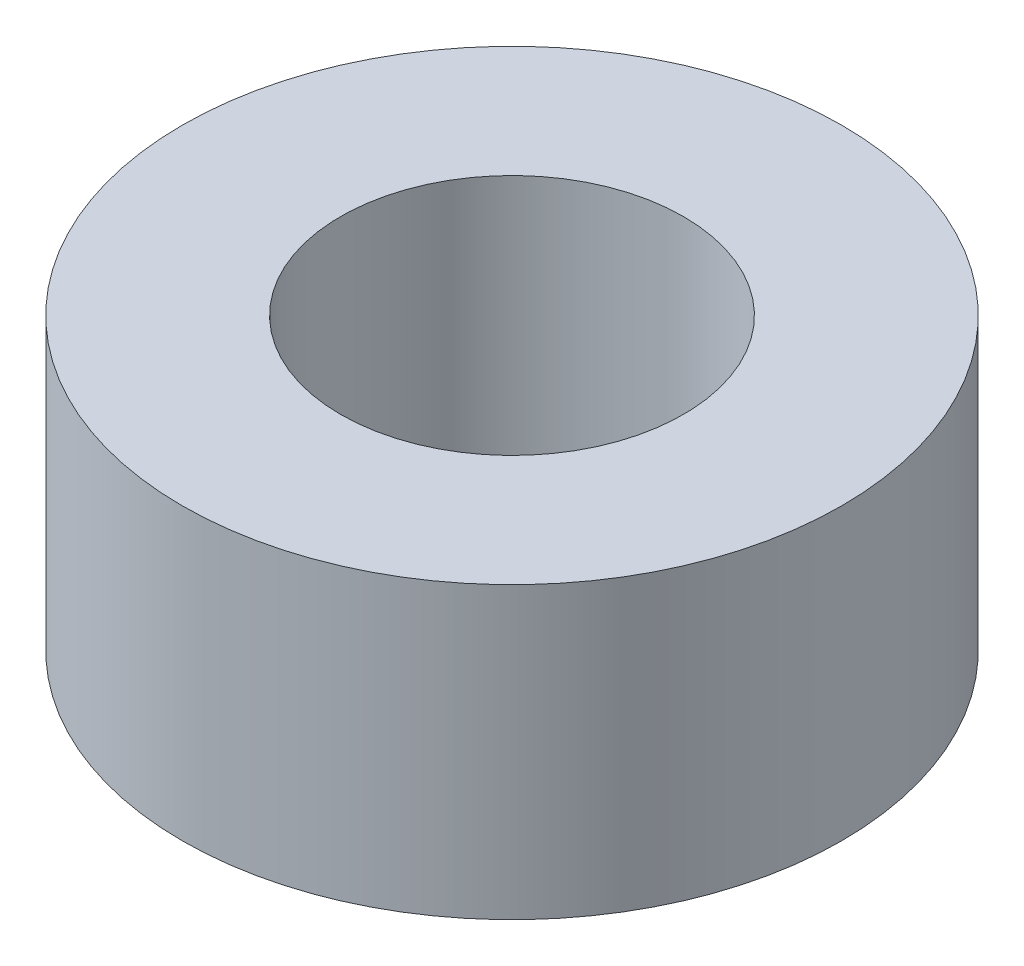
from build123d import *

# Parameters (mm, degrees)
SKETCH1_R      = 3.175
SKETCH1_R_2    = 1.651
EXTRUDE1_DEPTH = 1.397


with BuildPart() as part:
    # Sketch1 → Extrude1 (new, symmetric)
    with BuildSketch(Plane(origin=(0, 0, 0), x_dir=(1, 0, 0), z_dir=(0, 1, 0))):
        with Locations(Location((0, 0, 0), (0, 0, 270))):
            Circle(SKETCH1_R)
        with Locations(Location((0, 0, 0), (0, 0, 270))):
            Circle(SKETCH1_R_2, mode=Mode.SUBTRACT)
    extrude(amount=EXTRUDE1_DEPTH, both=True)


solid = part.part
